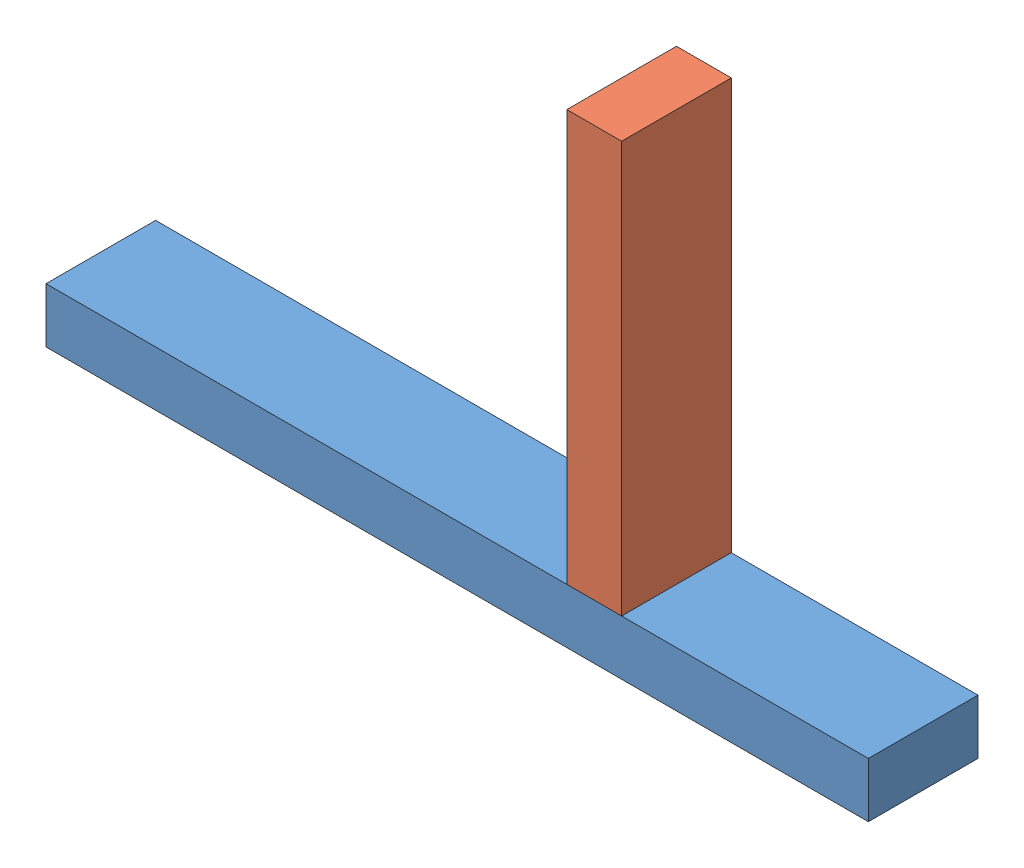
SolidWorks assembly Beam with Arm.SLDASM, configuration Default (file format 14000). Lengths in mm.
Overall size (750 425 100).
2 component instances, 2 part files, 4 mates.
Components (placement in the parent):
- Beam-1: Beam.SLDPRT [Default] at origin size (750 50 100)
- Arm-1: Arm.SLDPRT [Default] at (500 25 0) size (50 375 100)
Mates (geometry in assembly coordinates):
- Coincident1: coordinate: point of Beam-1
- Distance1: distance = 225 mm aligned: plane of Arm-1 through (525 400 50) normal (1 0 0); plane of Beam-1 through (750 0 0) normal (1 0 0)
- Coincident3: coincident anti-aligned: plane of Beam-1 through (750 25 50) normal (0 1 0); plane of Arm-1 through (500 25 0) normal (0 -1 0)
- Coincident4: coincident aligned: plane of Beam-1 through (750 -25 50) normal (0 0 1); plane of Arm-1 through (525 400 50) normal (0 0 1)
